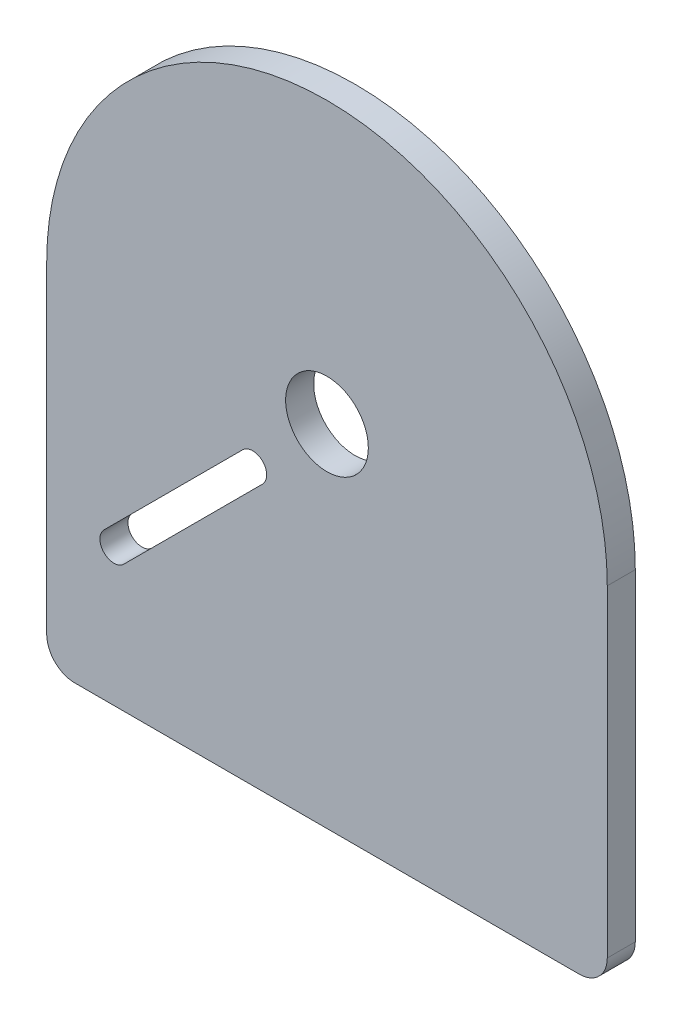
from build123d import *

# Parameters (mm, degrees)
ESQUISSE1_R      = 2.95
EXTRUSION1_DEPTH = 2


with BuildPart() as part:
    # Esquisse1 → Extrusion1 (new body)
    with BuildSketch(Plane.XY):
        with BuildLine():
            Line((-18, -25), (18, -25))
            ThreePointArc((18, -25), (19.414213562, -24.414213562), (20, -23))
            Line((20, -23), (20, 0))
            ThreePointArc((20, 0), (0, 20), (-20, 0))
            Line((-20, 0), (-20, -23))
            ThreePointArc((-20, -23), (-19.414213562, -24.414213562), (-18, -25))
        make_face()
        Circle(ESQUISSE1_R, mode=Mode.SUBTRACT)
        with BuildLine():
            Line((-6.01040764, -4.596194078), (-15.909902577, -14.495689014))
            ThreePointArc((-15.909902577, -14.495689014), (-15.909902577, -15.909902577), (-14.495689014, -15.909902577))
            Line((-14.495689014, -15.909902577), (-4.596194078, -6.01040764))
            ThreePointArc((-4.596194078, -6.01040764), (-4.596194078, -4.596194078), (-6.01040764, -4.596194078))
        make_face(mode=Mode.SUBTRACT)
    extrude(amount=EXTRUSION1_DEPTH)


solid = part.part
